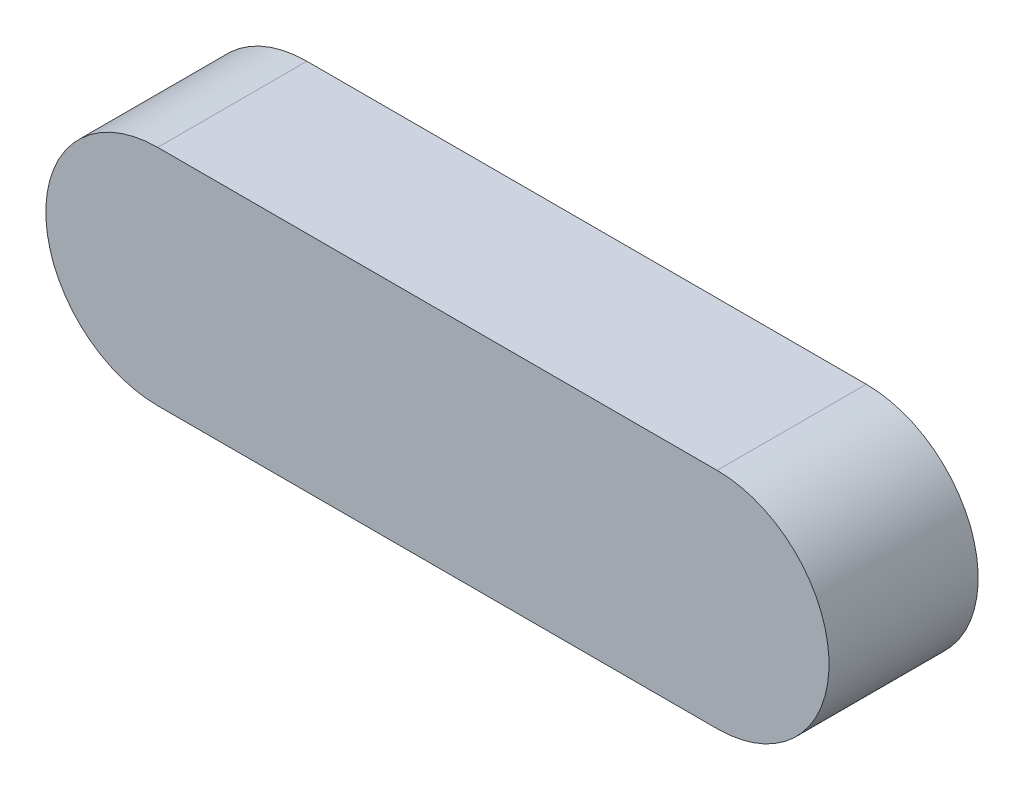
ISO-10303-21;
HEADER;
FILE_DESCRIPTION(('STEP AP214'),'2;1');
FILE_NAME('part.step','',(''),(''),'','','');
FILE_SCHEMA(('AUTOMOTIVE_DESIGN { 1 0 10303 214 1 1 1 1 }'));
ENDSEC;
DATA;
#1=APPLICATION_CONTEXT('core data for automotive mechanical design processes');
#2=APPLICATION_PROTOCOL_DEFINITION('international standard','automotive_design',2000,#1);
#3=PRODUCT_CONTEXT('',#1,'mechanical');
#4=PRODUCT('Part','Part','',(#3));
#5=PRODUCT_RELATED_PRODUCT_CATEGORY('part','',(#4));
#6=PRODUCT_DEFINITION_FORMATION('','',#4);
#7=PRODUCT_DEFINITION_CONTEXT('part definition',#1,'design');
#8=PRODUCT_DEFINITION('design','',#6,#7);
#9=PRODUCT_DEFINITION_SHAPE('','',#8);
#10=(LENGTH_UNIT() NAMED_UNIT(*) SI_UNIT(.MILLI.,.METRE.));
#11=(NAMED_UNIT(*) PLANE_ANGLE_UNIT() SI_UNIT($,.RADIAN.));
#12=(NAMED_UNIT(*) SI_UNIT($,.STERADIAN.) SOLID_ANGLE_UNIT());
#13=UNCERTAINTY_MEASURE_WITH_UNIT(LENGTH_MEASURE(1.E-05),#10,'distance_accuracy_value','');
#14=(GEOMETRIC_REPRESENTATION_CONTEXT(3) GLOBAL_UNCERTAINTY_ASSIGNED_CONTEXT((#13)) GLOBAL_UNIT_ASSIGNED_CONTEXT((#10,
#11,#12)) REPRESENTATION_CONTEXT('',''));
#15=CARTESIAN_POINT('',(0.,0.,0.));
#16=DIRECTION('',(0.,0.,1.));
#17=DIRECTION('',(1.,0.,0.));
#18=AXIS2_PLACEMENT_3D('',#15,#16,#17);
#19=CARTESIAN_POINT('',(-7.5,0.,2.));
#20=DIRECTION('',(0.,0.,-1.));
#21=DIRECTION('',(-1.,0.,0.));
#22=AXIS2_PLACEMENT_3D('',#19,#20,#21);
#23=CYLINDRICAL_SURFACE('',#22,1.5);
#24=CARTESIAN_POINT('',(-7.5,0.,0.));
#25=DIRECTION('',(0.,0.,1.));
#26=DIRECTION('',(1.,0.,0.));
#27=AXIS2_PLACEMENT_3D('',#24,#25,#26);
#28=CIRCLE('',#27,1.5);
#29=CARTESIAN_POINT('',(-7.5,1.5,0.));
#30=VERTEX_POINT('',#29);
#31=CARTESIAN_POINT('',(-7.5,-1.5,0.));
#32=VERTEX_POINT('',#31);
#33=EDGE_CURVE('E394',#30,#32,#28,.T.);
#34=ORIENTED_EDGE('',*,*,#33,.T.);
#35=DIRECTION('',(0.,0.,-1.));
#36=VECTOR('',#35,1.);
#37=CARTESIAN_POINT('',(-7.5,-1.5,2.));
#38=LINE('',#37,#36);
#39=CARTESIAN_POINT('',(-7.5,-1.5,2.));
#40=VERTEX_POINT('',#39);
#41=EDGE_CURVE('E11',#40,#32,#38,.T.);
#42=ORIENTED_EDGE('',*,*,#41,.F.);
#43=CARTESIAN_POINT('',(-7.5,0.,2.));
#44=DIRECTION('',(0.,0.,1.));
#45=DIRECTION('',(1.,0.,0.));
#46=AXIS2_PLACEMENT_3D('',#43,#44,#45);
#47=CIRCLE('',#46,1.5);
#48=CARTESIAN_POINT('',(-7.5,1.5,2.));
#49=VERTEX_POINT('',#48);
#50=EDGE_CURVE('E412',#49,#40,#47,.T.);
#51=ORIENTED_EDGE('',*,*,#50,.F.);
#52=DIRECTION('',(0.,0.,-1.));
#53=VECTOR('',#52,1.);
#54=CARTESIAN_POINT('',(-7.5,1.5,2.));
#55=LINE('',#54,#53);
#56=EDGE_CURVE('E406',#49,#30,#55,.T.);
#57=ORIENTED_EDGE('',*,*,#56,.T.);
#58=EDGE_LOOP('',(#34,#42,#51,#57));
#59=FACE_BOUND('',#58,.T.);
#60=ADVANCED_FACE('F350',(#59),#23,.T.);
#61=CARTESIAN_POINT('',(-7.5,-1.5,2.));
#62=DIRECTION('',(0.,1.,0.));
#63=DIRECTION('',(0.,0.,1.));
#64=AXIS2_PLACEMENT_3D('',#61,#62,#63);
#65=PLANE('',#64);
#66=DIRECTION('',(1.,0.,0.));
#67=VECTOR('',#66,1.);
#68=CARTESIAN_POINT('',(-7.5,-1.5,0.));
#69=LINE('',#68,#67);
#70=CARTESIAN_POINT('',(0.,-1.5,0.));
#71=VERTEX_POINT('',#70);
#72=EDGE_CURVE('E390',#32,#71,#69,.T.);
#73=ORIENTED_EDGE('',*,*,#72,.T.);
#74=DIRECTION('',(0.,0.,-1.));
#75=VECTOR('',#74,1.);
#76=CARTESIAN_POINT('',(0.,-1.5,2.));
#77=LINE('',#76,#75);
#78=CARTESIAN_POINT('',(0.,-1.5,2.));
#79=VERTEX_POINT('',#78);
#80=EDGE_CURVE('E357',#79,#71,#77,.T.);
#81=ORIENTED_EDGE('',*,*,#80,.F.);
#82=DIRECTION('',(1.,0.,0.));
#83=VECTOR('',#82,1.);
#84=CARTESIAN_POINT('',(-7.5,-1.5,2.));
#85=LINE('',#84,#83);
#86=EDGE_CURVE('E402',#40,#79,#85,.T.);
#87=ORIENTED_EDGE('',*,*,#86,.F.);
#88=ORIENTED_EDGE('',*,*,#41,.T.);
#89=EDGE_LOOP('',(#73,#81,#87,#88));
#90=FACE_BOUND('',#89,.T.);
#91=ADVANCED_FACE('F401',(#90),#65,.F.);
#92=CARTESIAN_POINT('',(0.,0.,2.));
#93=DIRECTION('',(0.,0.,-1.));
#94=DIRECTION('',(-1.,0.,0.));
#95=AXIS2_PLACEMENT_3D('',#92,#93,#94);
#96=CYLINDRICAL_SURFACE('',#95,1.5);
#97=CARTESIAN_POINT('',(0.,0.,0.));
#98=DIRECTION('',(0.,0.,1.));
#99=DIRECTION('',(1.,0.,0.));
#100=AXIS2_PLACEMENT_3D('',#97,#98,#99);
#101=CIRCLE('',#100,1.5);
#102=CARTESIAN_POINT('',(0.,1.5,0.));
#103=VERTEX_POINT('',#102);
#104=EDGE_CURVE('E395',#71,#103,#101,.T.);
#105=ORIENTED_EDGE('',*,*,#104,.T.);
#106=DIRECTION('',(0.,0.,-1.));
#107=VECTOR('',#106,1.);
#108=CARTESIAN_POINT('',(0.,1.5,2.));
#109=LINE('',#108,#107);
#110=CARTESIAN_POINT('',(0.,1.5,2.));
#111=VERTEX_POINT('',#110);
#112=EDGE_CURVE('E418',#111,#103,#109,.T.);
#113=ORIENTED_EDGE('',*,*,#112,.F.);
#114=CARTESIAN_POINT('',(0.,0.,2.));
#115=DIRECTION('',(0.,0.,1.));
#116=DIRECTION('',(1.,0.,0.));
#117=AXIS2_PLACEMENT_3D('',#114,#115,#116);
#118=CIRCLE('',#117,1.5);
#119=EDGE_CURVE('E369',#79,#111,#118,.T.);
#120=ORIENTED_EDGE('',*,*,#119,.F.);
#121=ORIENTED_EDGE('',*,*,#80,.T.);
#122=EDGE_LOOP('',(#105,#113,#120,#121));
#123=FACE_BOUND('',#122,.T.);
#124=ADVANCED_FACE('F421',(#123),#96,.T.);
#125=CARTESIAN_POINT('',(-7.5,1.5,2.));
#126=DIRECTION('',(0.,-1.,0.));
#127=DIRECTION('',(0.,0.,-1.));
#128=AXIS2_PLACEMENT_3D('',#125,#126,#127);
#129=PLANE('',#128);
#130=DIRECTION('',(-1.,0.,0.));
#131=VECTOR('',#130,1.);
#132=CARTESIAN_POINT('',(-7.5,1.5,0.));
#133=LINE('',#132,#131);
#134=EDGE_CURVE('E410',#103,#30,#133,.T.);
#135=ORIENTED_EDGE('',*,*,#134,.T.);
#136=ORIENTED_EDGE('',*,*,#56,.F.);
#137=DIRECTION('',(-1.,0.,0.));
#138=VECTOR('',#137,1.);
#139=CARTESIAN_POINT('',(-7.5,1.5,2.));
#140=LINE('',#139,#138);
#141=EDGE_CURVE('E364',#111,#49,#140,.T.);
#142=ORIENTED_EDGE('',*,*,#141,.F.);
#143=ORIENTED_EDGE('',*,*,#112,.T.);
#144=EDGE_LOOP('',(#135,#136,#142,#143));
#145=FACE_BOUND('',#144,.T.);
#146=ADVANCED_FACE('F423',(#145),#129,.F.);
#147=CARTESIAN_POINT('',(-7.5,0.,2.));
#148=DIRECTION('',(0.,0.,1.));
#149=DIRECTION('',(1.,0.,0.));
#150=AXIS2_PLACEMENT_3D('',#147,#148,#149);
#151=PLANE('',#150);
#152=ORIENTED_EDGE('',*,*,#50,.T.);
#153=ORIENTED_EDGE('',*,*,#86,.T.);
#154=ORIENTED_EDGE('',*,*,#119,.T.);
#155=ORIENTED_EDGE('',*,*,#141,.T.);
#156=EDGE_LOOP('',(#152,#153,#154,#155));
#157=FACE_BOUND('',#156,.T.);
#158=ADVANCED_FACE('F424',(#157),#151,.T.);
#159=CARTESIAN_POINT('',(-7.5,0.,0.));
#160=DIRECTION('',(0.,0.,1.));
#161=DIRECTION('',(1.,0.,0.));
#162=AXIS2_PLACEMENT_3D('',#159,#160,#161);
#163=PLANE('',#162);
#164=ORIENTED_EDGE('',*,*,#33,.F.);
#165=ORIENTED_EDGE('',*,*,#134,.F.);
#166=ORIENTED_EDGE('',*,*,#104,.F.);
#167=ORIENTED_EDGE('',*,*,#72,.F.);
#168=EDGE_LOOP('',(#164,#165,#166,#167));
#169=FACE_BOUND('',#168,.T.);
#170=ADVANCED_FACE('F391',(#169),#163,.F.);
#171=CLOSED_SHELL('',(#60,#91,#124,#146,#158,#170));
#172=MANIFOLD_SOLID_BREP('B2',#171);
#173=ADVANCED_BREP_SHAPE_REPRESENTATION('',(#18,#172),#14);
#174=SHAPE_DEFINITION_REPRESENTATION(#9,#173);
ENDSEC;
END-ISO-10303-21;
